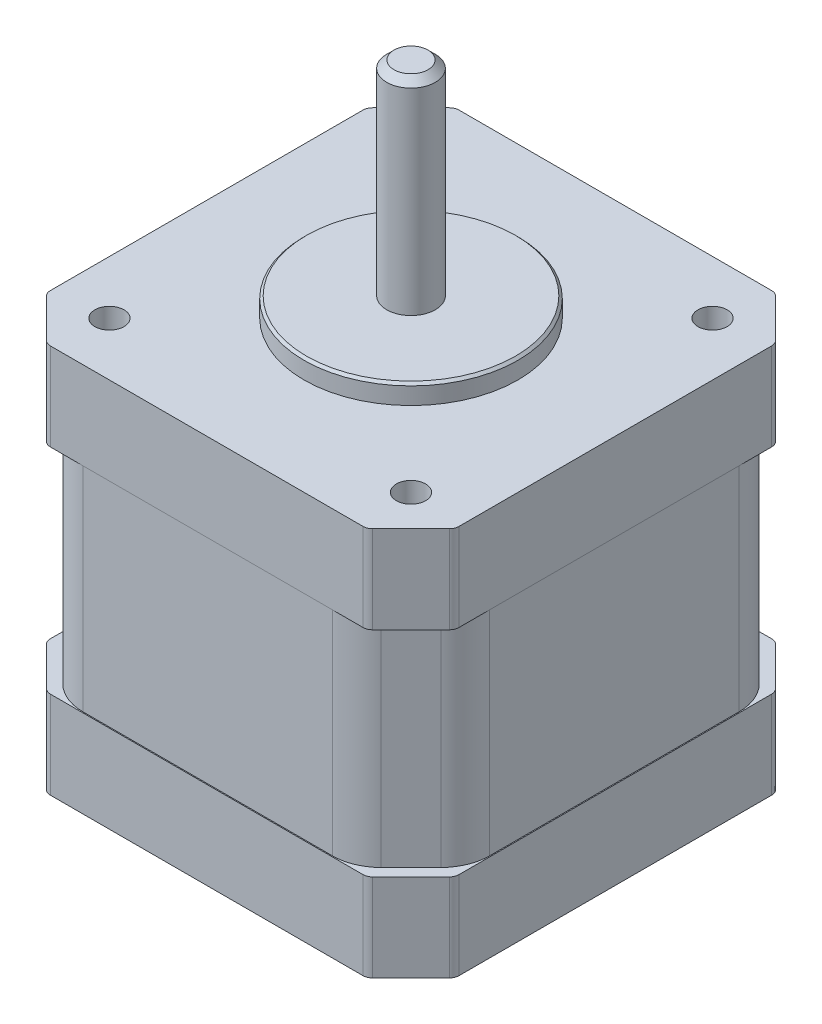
from build123d import *

# Parameters (mm, degrees)
BOSS_EXTRUDE1_DEPTH = 9
BOSS_EXTRUDE4_DEPTH = 22
BOSS_EXTRUDE5_DEPTH = 9
SKETCH5_R           = 11
BOSS_EXTRUDE6_DEPTH = 2
CHAMFER1_SIZE       = 0.25
SKETCH6_R           = 2.5
BOSS_EXTRUDE7_DEPTH = 21
CHAMFER2_SIZE       = 0.75
FILLET2_R           = 1
FILLET3_R           = 5
SKETCH7_R           = 4.5
CUT_EXTRUDE1_DEPTH  = 3
SKETCH8_R           = 1.5
CUT_EXTRUDE2_DEPTH  = 50.819674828
SKETCH9_R           = 3
CUT_EXTRUDE3_DEPTH  = 1.3


with BuildPart() as part:
    # Sketch1 → Boss-Extrude1 (new body)
    with BuildSketch(Plane(origin=(0, 0, 0), x_dir=(1, 0, 0), z_dir=(0, 1, 0))):
        Polygon((-16.476659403, 21), (-21, 16.476659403), (-21, -16.476659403), (-16.476659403, -21), (16.476659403, -21), (21, -16.476659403), (21, 16.476659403), (16.476659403, 21), align=None)
    extrude(amount=BOSS_EXTRUDE1_DEPTH)

    # Sketch2 → Boss-Extrude4 (add)
    with BuildSketch(Plane(origin=(0, 9, 0), x_dir=(1, 0, 0), z_dir=(0, 1, 0))):
        Polygon((14.9, -20.9), (-14.9, -20.9), (-20.9, -14.9), (-20.9, 14.9), (-14.9, 20.9), (14.9, 20.9), (20.9, 14.9), (20.9, -14.9), align=None)
    extrude(amount=BOSS_EXTRUDE4_DEPTH)

    # Sketch4 → Boss-Extrude5 (add)
    with BuildSketch(Plane(origin=(0, 31, 0), x_dir=(1, 0, 0), z_dir=(0, 1, 0))):
        Polygon((16.476659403, -21), (-16.476659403, -21), (-21, -16.476659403), (-21, 16.476659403), (-16.476659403, 21), (16.476659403, 21), (21, 16.476659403), (21, -16.476659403), align=None)
    extrude(amount=BOSS_EXTRUDE5_DEPTH)

    # Sketch5 → Boss-Extrude6 (add)
    with BuildSketch(Plane(origin=(0, 40, 0), x_dir=(1, 0, 0), z_dir=(0, 1, 0))):
        with Locations(Location((0, 0, 0), (0, 0, 90))):
            Circle(SKETCH5_R)
    extrude(amount=BOSS_EXTRUDE6_DEPTH)

    # Chamfer1
    chamfer1_edges = [part.edges().sort_by_distance(p)[0] for p in [
        (0, 42, 11),
    ]]
    chamfer(chamfer1_edges, length=CHAMFER1_SIZE)

    # Sketch6 → Boss-Extrude7 (add)
    with BuildSketch(Plane(origin=(0, 42, 0), x_dir=(1, 0, 0), z_dir=(0, 1, 0))):
        with Locations(Location((0, 0, 0), (0, 0, 90))):
            Circle(SKETCH6_R)
    extrude(amount=BOSS_EXTRUDE7_DEPTH)

    # Chamfer2
    chamfer2_edges = [part.edges().sort_by_distance(p)[0] for p in [
        (0, 63, 2.5),
    ]]
    chamfer(chamfer2_edges, length=CHAMFER2_SIZE)

    # Fillet2
    fillet2_edges = [part.edges().sort_by_distance(p)[0] for p in [
        (16.476659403, 4.5, -21),
        (21, 4.5, -16.476659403),
        (21, 4.5, 16.476659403),
        (16.476659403, 4.5, 21),
        (-16.476659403, 4.5, 21),
        (-21, 4.5, 16.476659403),
        (-21, 4.5, -16.476659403),
        (-16.476659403, 4.5, -21),
        (-16.476659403, 35.5, -21),
        (-21, 35.5, -16.476659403),
        (-21, 35.5, 16.476659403),
        (-16.476659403, 35.5, 21),
        (16.476659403, 35.5, 21),
        (21, 35.5, 16.476659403),
        (21, 35.5, -16.476659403),
        (16.476659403, 35.5, -21),
    ]]
    fillet(fillet2_edges, radius=FILLET2_R)

    # Fillet3
    fillet3_edges = [part.edges().sort_by_distance(p)[0] for p in [
        (-14.9, 20, -20.9),
        (-20.9, 20, -14.9),
        (-20.9, 20, 14.9),
        (-14.9, 20, 20.9),
        (14.9, 20, 20.9),
        (20.9, 20, 14.9),
        (20.9, 20, -14.9),
        (14.9, 20, -20.9),
    ]]
    fillet(fillet3_edges, radius=FILLET3_R)

    # Sketch7 → Cut-Extrude1 (cut)
    with BuildSketch(Plane.XZ):
        with Locations(Location((0, 0, 0), (0, 0, 270))):
            Circle(SKETCH7_R)
    extrude(amount=-CUT_EXTRUDE1_DEPTH, mode=Mode.SUBTRACT)

    # Sketch8 → Cut-Extrude2 (cut, through all)
    with BuildSketch(Plane(origin=(0, 40, 0), x_dir=(1, 0, 0), z_dir=(0, 1, 0))):
        with Locations(Location((-15.5, -15.5, 0), (0, 0, 270))):
            Circle(SKETCH8_R)
        with Locations(Location((-15.5, 15.5, 0), (0, 0, 270))):
            Circle(SKETCH8_R)
        with Locations(Location((15.5, 15.5, 0), (0, 0, 270))):
            Circle(SKETCH8_R)
        with Locations(Location((15.5, -15.5, 0), (0, 0, 270))):
            Circle(SKETCH8_R)
    extrude(amount=-CUT_EXTRUDE2_DEPTH, mode=Mode.SUBTRACT)

    # Sketch9 → Cut-Extrude3 (cut)
    with BuildSketch(Plane.XZ):
        with Locations(Location((-15.5, 15.5, 0), (0, 0, 270))):
            Circle(SKETCH9_R)
        with Locations(Location((15.5, 15.5, 0), (0, 0, 270))):
            Circle(SKETCH9_R)
        with Locations(Location((-15.5, -15.5, 0), (0, 0, 270))):
            Circle(SKETCH9_R)
        with Locations(Location((15.5, -15.5, 0), (0, 0, 270))):
            Circle(SKETCH9_R)
    extrude(amount=-CUT_EXTRUDE3_DEPTH, mode=Mode.SUBTRACT)


solid = part.part
